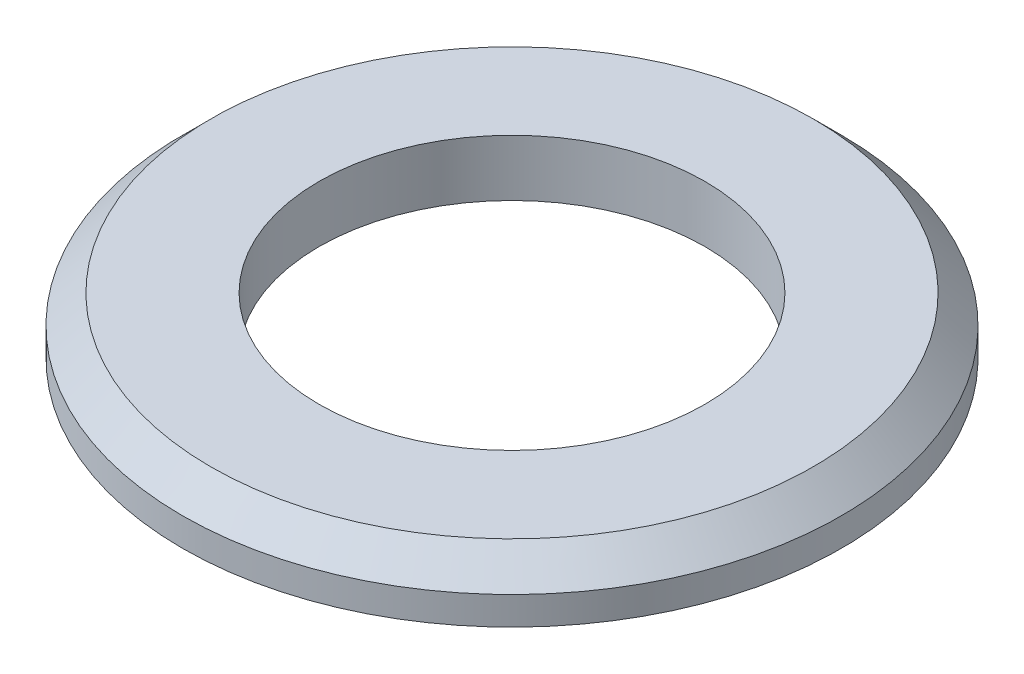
ISO-10303-21;
HEADER;
FILE_DESCRIPTION(('STEP AP214'),'2;1');
FILE_NAME('part.step','',(''),(''),'','','');
FILE_SCHEMA(('AUTOMOTIVE_DESIGN { 1 0 10303 214 1 1 1 1 }'));
ENDSEC;
DATA;
#1=APPLICATION_CONTEXT('core data for automotive mechanical design processes');
#2=APPLICATION_PROTOCOL_DEFINITION('international standard','automotive_design',2000,#1);
#3=PRODUCT_CONTEXT('',#1,'mechanical');
#4=PRODUCT('Part','Part','',(#3));
#5=PRODUCT_RELATED_PRODUCT_CATEGORY('part','',(#4));
#6=PRODUCT_DEFINITION_FORMATION('','',#4);
#7=PRODUCT_DEFINITION_CONTEXT('part definition',#1,'design');
#8=PRODUCT_DEFINITION('design','',#6,#7);
#9=PRODUCT_DEFINITION_SHAPE('','',#8);
#10=(LENGTH_UNIT() NAMED_UNIT(*) SI_UNIT(.MILLI.,.METRE.));
#11=(NAMED_UNIT(*) PLANE_ANGLE_UNIT() SI_UNIT($,.RADIAN.));
#12=(NAMED_UNIT(*) SI_UNIT($,.STERADIAN.) SOLID_ANGLE_UNIT());
#13=UNCERTAINTY_MEASURE_WITH_UNIT(LENGTH_MEASURE(1.E-05),#10,'distance_accuracy_value','');
#14=(GEOMETRIC_REPRESENTATION_CONTEXT(3) GLOBAL_UNCERTAINTY_ASSIGNED_CONTEXT((#13)) GLOBAL_UNIT_ASSIGNED_CONTEXT((#10,
#11,#12)) REPRESENTATION_CONTEXT('',''));
#15=CARTESIAN_POINT('',(0.,0.,0.));
#16=DIRECTION('',(0.,0.,1.));
#17=DIRECTION('',(1.,0.,0.));
#18=AXIS2_PLACEMENT_3D('',#15,#16,#17);
#19=CARTESIAN_POINT('',(0.,12.,0.));
#20=DIRECTION('',(0.,1.,0.));
#21=DIRECTION('',(0.,0.,1.));
#22=AXIS2_PLACEMENT_3D('',#19,#20,#21);
#23=PLANE('',#22);
#24=CARTESIAN_POINT('',(0.,12.,0.));
#25=DIRECTION('',(0.,1.,0.));
#26=DIRECTION('',(0.,0.,1.));
#27=AXIS2_PLACEMENT_3D('',#24,#25,#26);
#28=CIRCLE('',#27,63.9999999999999);
#29=CARTESIAN_POINT('',(0.,12.,63.9999999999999));
#30=VERTEX_POINT('',#29);
#31=EDGE_CURVE('E35',#30,#30,#28,.T.);
#32=ORIENTED_EDGE('',*,*,#31,.T.);
#33=EDGE_LOOP('',(#32));
#34=FACE_BOUND('',#33,.T.);
#35=CARTESIAN_POINT('',(0.,12.,0.));
#36=DIRECTION('',(0.,1.,0.));
#37=DIRECTION('',(0.,0.,1.));
#38=AXIS2_PLACEMENT_3D('',#35,#36,#37);
#39=CIRCLE('',#38,41.);
#40=CARTESIAN_POINT('',(0.,12.,41.));
#41=VERTEX_POINT('',#40);
#42=EDGE_CURVE('E43',#41,#41,#39,.T.);
#43=ORIENTED_EDGE('',*,*,#42,.F.);
#44=EDGE_LOOP('',(#43));
#45=FACE_BOUND('',#44,.T.);
#46=ADVANCED_FACE('F28',(#34,#45),#23,.T.);
#47=CARTESIAN_POINT('',(0.,0.,0.));
#48=DIRECTION('',(0.,1.,0.));
#49=DIRECTION('',(0.,0.,1.));
#50=AXIS2_PLACEMENT_3D('',#47,#48,#49);
#51=PLANE('',#50);
#52=CARTESIAN_POINT('',(0.,0.,0.));
#53=DIRECTION('',(0.,1.,0.));
#54=DIRECTION('',(0.,0.,1.));
#55=AXIS2_PLACEMENT_3D('',#52,#53,#54);
#56=CIRCLE('',#55,70.);
#57=CARTESIAN_POINT('',(0.,0.,70.));
#58=VERTEX_POINT('',#57);
#59=EDGE_CURVE('E39',#58,#58,#56,.T.);
#60=ORIENTED_EDGE('',*,*,#59,.F.);
#61=EDGE_LOOP('',(#60));
#62=FACE_BOUND('',#61,.T.);
#63=CARTESIAN_POINT('',(0.,0.,0.));
#64=DIRECTION('',(0.,1.,0.));
#65=DIRECTION('',(0.,0.,1.));
#66=AXIS2_PLACEMENT_3D('',#63,#64,#65);
#67=CIRCLE('',#66,41.);
#68=CARTESIAN_POINT('',(0.,0.,41.));
#69=VERTEX_POINT('',#68);
#70=EDGE_CURVE('E48',#69,#69,#67,.T.);
#71=ORIENTED_EDGE('',*,*,#70,.T.);
#72=EDGE_LOOP('',(#71));
#73=FACE_BOUND('',#72,.T.);
#74=ADVANCED_FACE('F52',(#62,#73),#51,.F.);
#75=CARTESIAN_POINT('',(0.,12.,0.));
#76=DIRECTION('',(0.,-1.,0.));
#77=DIRECTION('',(0.,0.,-1.));
#78=AXIS2_PLACEMENT_3D('',#75,#76,#77);
#79=CYLINDRICAL_SURFACE('',#78,70.);
#80=CARTESIAN_POINT('',(0.,5.99999999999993,0.));
#81=DIRECTION('',(0.,1.,0.));
#82=DIRECTION('',(0.,0.,1.));
#83=AXIS2_PLACEMENT_3D('',#80,#81,#82);
#84=CIRCLE('',#83,70.);
#85=CARTESIAN_POINT('',(0.,5.99999999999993,70.));
#86=VERTEX_POINT('',#85);
#87=EDGE_CURVE('E10',#86,#86,#84,.F.);
#88=ORIENTED_EDGE('',*,*,#87,.T.);
#89=EDGE_LOOP('',(#88));
#90=FACE_BOUND('',#89,.T.);
#91=ORIENTED_EDGE('',*,*,#59,.T.);
#92=EDGE_LOOP('',(#91));
#93=FACE_BOUND('',#92,.T.);
#94=ADVANCED_FACE('F30',(#90,#93),#79,.T.);
#95=CARTESIAN_POINT('',(0.,12.,0.));
#96=DIRECTION('',(0.,-1.,0.));
#97=DIRECTION('',(0.,0.,-1.));
#98=AXIS2_PLACEMENT_3D('',#95,#96,#97);
#99=CYLINDRICAL_SURFACE('',#98,41.);
#100=ORIENTED_EDGE('',*,*,#42,.T.);
#101=EDGE_LOOP('',(#100));
#102=FACE_BOUND('',#101,.T.);
#103=ORIENTED_EDGE('',*,*,#70,.F.);
#104=EDGE_LOOP('',(#103));
#105=FACE_BOUND('',#104,.T.);
#106=ADVANCED_FACE('F54',(#102,#105),#99,.F.);
#107=CARTESIAN_POINT('',(0.,12.,0.));
#108=DIRECTION('',(0.,-1.,0.));
#109=DIRECTION('',(0.,0.,-1.));
#110=AXIS2_PLACEMENT_3D('',#107,#108,#109);
#111=CONICAL_SURFACE('',#110,63.9999999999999,0.785398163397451);
#112=ORIENTED_EDGE('',*,*,#87,.F.);
#113=EDGE_LOOP('',(#112));
#114=FACE_BOUND('',#113,.T.);
#115=ORIENTED_EDGE('',*,*,#31,.F.);
#116=EDGE_LOOP('',(#115));
#117=FACE_BOUND('',#116,.T.);
#118=ADVANCED_FACE('F56',(#114,#117),#111,.T.);
#119=CLOSED_SHELL('',(#46,#74,#94,#106,#118));
#120=MANIFOLD_SOLID_BREP('B2',#119);
#121=ADVANCED_BREP_SHAPE_REPRESENTATION('',(#18,#120),#14);
#122=SHAPE_DEFINITION_REPRESENTATION(#9,#121);
ENDSEC;
END-ISO-10303-21;
